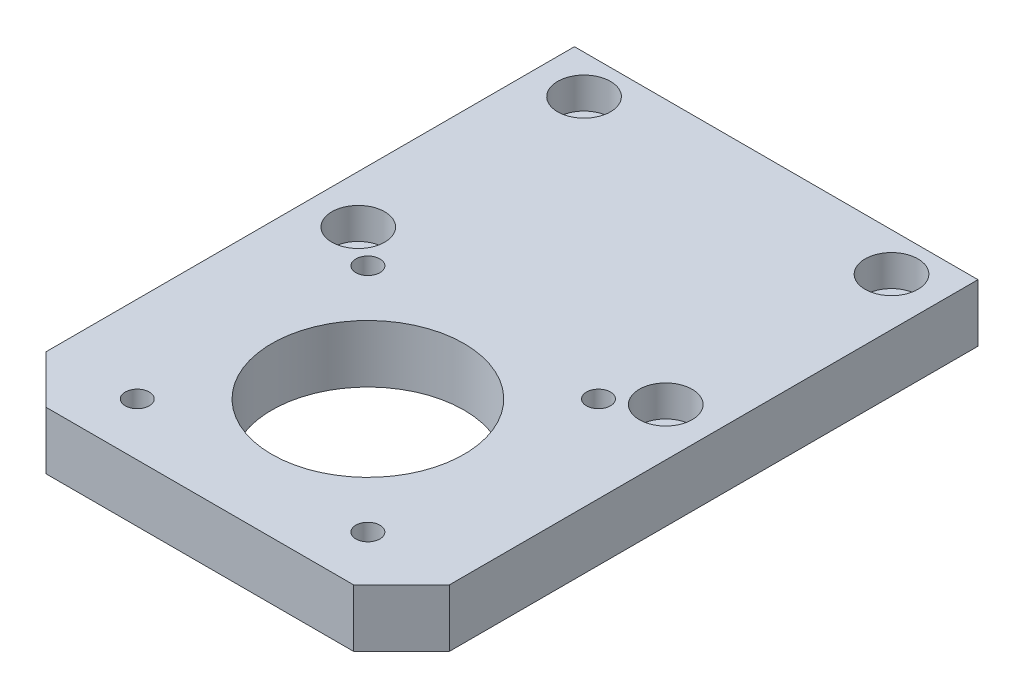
ISO-10303-21;
HEADER;
FILE_DESCRIPTION(('STEP AP214'),'2;1');
FILE_NAME('part.step','',(''),(''),'','','');
FILE_SCHEMA(('AUTOMOTIVE_DESIGN { 1 0 10303 214 1 1 1 1 }'));
ENDSEC;
DATA;
#1=APPLICATION_CONTEXT('core data for automotive mechanical design processes');
#2=APPLICATION_PROTOCOL_DEFINITION('international standard','automotive_design',2000,#1);
#3=PRODUCT_CONTEXT('',#1,'mechanical');
#4=PRODUCT('Part','Part','',(#3));
#5=PRODUCT_RELATED_PRODUCT_CATEGORY('part','',(#4));
#6=PRODUCT_DEFINITION_FORMATION('','',#4);
#7=PRODUCT_DEFINITION_CONTEXT('part definition',#1,'design');
#8=PRODUCT_DEFINITION('design','',#6,#7);
#9=PRODUCT_DEFINITION_SHAPE('','',#8);
#10=(LENGTH_UNIT() NAMED_UNIT(*) SI_UNIT(.MILLI.,.METRE.));
#11=(NAMED_UNIT(*) PLANE_ANGLE_UNIT() SI_UNIT($,.RADIAN.));
#12=(NAMED_UNIT(*) SI_UNIT($,.STERADIAN.) SOLID_ANGLE_UNIT());
#13=UNCERTAINTY_MEASURE_WITH_UNIT(LENGTH_MEASURE(1.E-05),#10,'distance_accuracy_value','');
#14=(GEOMETRIC_REPRESENTATION_CONTEXT(3) GLOBAL_UNCERTAINTY_ASSIGNED_CONTEXT((#13)) GLOBAL_UNIT_ASSIGNED_CONTEXT((#10,
#11,#12)) REPRESENTATION_CONTEXT('',''));
#15=CARTESIAN_POINT('',(0.,0.,0.));
#16=DIRECTION('',(0.,0.,1.));
#17=DIRECTION('',(1.,0.,0.));
#18=AXIS2_PLACEMENT_3D('',#15,#16,#17);
#19=CARTESIAN_POINT('',(10.,-108.,8.));
#20=DIRECTION('',(0.,1.,0.));
#21=DIRECTION('',(0.,0.,1.));
#22=AXIS2_PLACEMENT_3D('',#19,#20,#21);
#23=CYLINDRICAL_SURFACE('',#22,3.25);
#24=CARTESIAN_POINT('',(10.,0.,8.));
#25=DIRECTION('',(0.,1.,0.));
#26=DIRECTION('',(0.,0.,1.));
#27=AXIS2_PLACEMENT_3D('',#24,#25,#26);
#28=CIRCLE('',#27,3.25);
#29=CARTESIAN_POINT('',(10.,0.,11.25));
#30=VERTEX_POINT('',#29);
#31=EDGE_CURVE('E157',#30,#30,#28,.T.);
#32=ORIENTED_EDGE('',*,*,#31,.F.);
#33=EDGE_LOOP('',(#32));
#34=FACE_BOUND('',#33,.T.);
#35=CARTESIAN_POINT('',(10.,5.50000000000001,8.));
#36=DIRECTION('',(0.,1.,0.));
#37=DIRECTION('',(0.,0.,1.));
#38=AXIS2_PLACEMENT_3D('',#35,#36,#37);
#39=CIRCLE('',#38,3.25);
#40=CARTESIAN_POINT('',(10.,5.50000000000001,11.25));
#41=VERTEX_POINT('',#40);
#42=EDGE_CURVE('E37',#41,#41,#39,.F.);
#43=ORIENTED_EDGE('',*,*,#42,.F.);
#44=EDGE_LOOP('',(#43));
#45=FACE_BOUND('',#44,.T.);
#46=ADVANCED_FACE('F33',(#34,#45),#23,.F.);
#47=CARTESIAN_POINT('',(74.,-108.,8.));
#48=DIRECTION('',(0.,1.,0.));
#49=DIRECTION('',(0.,0.,1.));
#50=AXIS2_PLACEMENT_3D('',#47,#48,#49);
#51=CYLINDRICAL_SURFACE('',#50,3.25);
#52=CARTESIAN_POINT('',(74.,0.,8.));
#53=DIRECTION('',(0.,1.,0.));
#54=DIRECTION('',(0.,0.,1.));
#55=AXIS2_PLACEMENT_3D('',#52,#53,#54);
#56=CIRCLE('',#55,3.25);
#57=CARTESIAN_POINT('',(74.,0.,11.25));
#58=VERTEX_POINT('',#57);
#59=EDGE_CURVE('E160',#58,#58,#56,.T.);
#60=ORIENTED_EDGE('',*,*,#59,.F.);
#61=EDGE_LOOP('',(#60));
#62=FACE_BOUND('',#61,.T.);
#63=CARTESIAN_POINT('',(74.,5.50000000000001,8.));
#64=DIRECTION('',(0.,1.,0.));
#65=DIRECTION('',(0.,0.,1.));
#66=AXIS2_PLACEMENT_3D('',#63,#64,#65);
#67=CIRCLE('',#66,3.25);
#68=CARTESIAN_POINT('',(74.,5.50000000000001,11.25));
#69=VERTEX_POINT('',#68);
#70=EDGE_CURVE('E127',#69,#69,#67,.F.);
#71=ORIENTED_EDGE('',*,*,#70,.F.);
#72=EDGE_LOOP('',(#71));
#73=FACE_BOUND('',#72,.T.);
#74=ADVANCED_FACE('F235',(#62,#73),#51,.F.);
#75=CARTESIAN_POINT('',(74.,-108.,55.));
#76=DIRECTION('',(0.,1.,0.));
#77=DIRECTION('',(0.,0.,1.));
#78=AXIS2_PLACEMENT_3D('',#75,#76,#77);
#79=CYLINDRICAL_SURFACE('',#78,3.25);
#80=CARTESIAN_POINT('',(74.,0.,55.));
#81=DIRECTION('',(0.,1.,0.));
#82=DIRECTION('',(0.,0.,1.));
#83=AXIS2_PLACEMENT_3D('',#80,#81,#82);
#84=CIRCLE('',#83,3.25);
#85=CARTESIAN_POINT('',(74.,0.,58.25));
#86=VERTEX_POINT('',#85);
#87=EDGE_CURVE('E193',#86,#86,#84,.T.);
#88=ORIENTED_EDGE('',*,*,#87,.F.);
#89=EDGE_LOOP('',(#88));
#90=FACE_BOUND('',#89,.T.);
#91=CARTESIAN_POINT('',(74.,5.50000000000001,55.));
#92=DIRECTION('',(0.,1.,0.));
#93=DIRECTION('',(0.,0.,1.));
#94=AXIS2_PLACEMENT_3D('',#91,#92,#93);
#95=CIRCLE('',#94,3.25);
#96=CARTESIAN_POINT('',(74.,5.50000000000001,58.25));
#97=VERTEX_POINT('',#96);
#98=EDGE_CURVE('E123',#97,#97,#95,.F.);
#99=ORIENTED_EDGE('',*,*,#98,.F.);
#100=EDGE_LOOP('',(#99));
#101=FACE_BOUND('',#100,.T.);
#102=ADVANCED_FACE('F241',(#90,#101),#79,.F.);
#103=CARTESIAN_POINT('',(10.,-108.,55.));
#104=DIRECTION('',(0.,1.,0.));
#105=DIRECTION('',(0.,0.,1.));
#106=AXIS2_PLACEMENT_3D('',#103,#104,#105);
#107=CYLINDRICAL_SURFACE('',#106,3.25);
#108=CARTESIAN_POINT('',(10.,0.,55.));
#109=DIRECTION('',(0.,1.,0.));
#110=DIRECTION('',(0.,0.,1.));
#111=AXIS2_PLACEMENT_3D('',#108,#109,#110);
#112=CIRCLE('',#111,3.25);
#113=CARTESIAN_POINT('',(10.,0.,58.25));
#114=VERTEX_POINT('',#113);
#115=EDGE_CURVE('E196',#114,#114,#112,.T.);
#116=ORIENTED_EDGE('',*,*,#115,.F.);
#117=EDGE_LOOP('',(#116));
#118=FACE_BOUND('',#117,.T.);
#119=CARTESIAN_POINT('',(10.,5.50000000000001,55.));
#120=DIRECTION('',(0.,1.,0.));
#121=DIRECTION('',(0.,0.,1.));
#122=AXIS2_PLACEMENT_3D('',#119,#120,#121);
#123=CIRCLE('',#122,3.25);
#124=CARTESIAN_POINT('',(10.,5.50000000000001,58.25));
#125=VERTEX_POINT('',#124);
#126=EDGE_CURVE('E119',#125,#125,#123,.F.);
#127=ORIENTED_EDGE('',*,*,#126,.F.);
#128=EDGE_LOOP('',(#127));
#129=FACE_BOUND('',#128,.T.);
#130=ADVANCED_FACE('F269',(#118,#129),#107,.F.);
#131=CARTESIAN_POINT('',(0.,0.,120.));
#132=DIRECTION('',(1.,0.,0.));
#133=DIRECTION('',(0.,0.,-1.));
#134=AXIS2_PLACEMENT_3D('',#131,#132,#133);
#135=PLANE('',#134);
#136=DIRECTION('',(0.,1.,0.));
#137=VECTOR('',#136,1.);
#138=CARTESIAN_POINT('',(0.,-108.,110.));
#139=LINE('',#138,#137);
#140=CARTESIAN_POINT('',(0.,0.,110.));
#141=VERTEX_POINT('',#140);
#142=CARTESIAN_POINT('',(0.,12.,110.));
#143=VERTEX_POINT('',#142);
#144=EDGE_CURVE('E92',#141,#143,#139,.T.);
#145=ORIENTED_EDGE('',*,*,#144,.T.);
#146=DIRECTION('',(0.,0.,-1.));
#147=VECTOR('',#146,1.);
#148=CARTESIAN_POINT('',(0.,12.,120.));
#149=LINE('',#148,#147);
#150=CARTESIAN_POINT('',(0.,12.,0.));
#151=VERTEX_POINT('',#150);
#152=EDGE_CURVE('E110',#143,#151,#149,.T.);
#153=ORIENTED_EDGE('',*,*,#152,.T.);
#154=DIRECTION('',(0.,-1.,0.));
#155=VECTOR('',#154,1.);
#156=CARTESIAN_POINT('',(0.,0.,0.));
#157=LINE('',#156,#155);
#158=CARTESIAN_POINT('',(0.,0.,0.));
#159=VERTEX_POINT('',#158);
#160=EDGE_CURVE('E199',#151,#159,#157,.T.);
#161=ORIENTED_EDGE('',*,*,#160,.T.);
#162=DIRECTION('',(0.,0.,-1.));
#163=VECTOR('',#162,1.);
#164=CARTESIAN_POINT('',(0.,0.,120.));
#165=LINE('',#164,#163);
#166=EDGE_CURVE('E112',#141,#159,#165,.T.);
#167=ORIENTED_EDGE('',*,*,#166,.F.);
#168=EDGE_LOOP('',(#145,#153,#161,#167));
#169=FACE_BOUND('',#168,.T.);
#170=ADVANCED_FACE('F35',(#169),#135,.F.);
#171=CARTESIAN_POINT('',(0.,0.,120.));
#172=DIRECTION('',(0.,1.,0.));
#173=DIRECTION('',(0.,0.,1.));
#174=AXIS2_PLACEMENT_3D('',#171,#172,#173);
#175=PLANE('',#174);
#176=ORIENTED_EDGE('',*,*,#31,.T.);
#177=EDGE_LOOP('',(#176));
#178=FACE_BOUND('',#177,.T.);
#179=ORIENTED_EDGE('',*,*,#59,.T.);
#180=EDGE_LOOP('',(#179));
#181=FACE_BOUND('',#180,.T.);
#182=CARTESIAN_POINT('',(42.,0.,85.));
#183=DIRECTION('',(0.,1.,0.));
#184=DIRECTION('',(0.,0.,1.));
#185=AXIS2_PLACEMENT_3D('',#182,#183,#184);
#186=CIRCLE('',#185,20.);
#187=CARTESIAN_POINT('',(42.,0.,105.));
#188=VERTEX_POINT('',#187);
#189=EDGE_CURVE('E166',#188,#188,#186,.T.);
#190=ORIENTED_EDGE('',*,*,#189,.T.);
#191=EDGE_LOOP('',(#190));
#192=FACE_BOUND('',#191,.T.);
#193=CARTESIAN_POINT('',(18.,0.,109.));
#194=DIRECTION('',(0.,1.,0.));
#195=DIRECTION('',(0.,0.,1.));
#196=AXIS2_PLACEMENT_3D('',#193,#194,#195);
#197=CIRCLE('',#196,2.5);
#198=CARTESIAN_POINT('',(18.,0.,111.5));
#199=VERTEX_POINT('',#198);
#200=EDGE_CURVE('E172',#199,#199,#197,.T.);
#201=ORIENTED_EDGE('',*,*,#200,.T.);
#202=EDGE_LOOP('',(#201));
#203=FACE_BOUND('',#202,.T.);
#204=CARTESIAN_POINT('',(66.,0.,109.));
#205=DIRECTION('',(0.,1.,0.));
#206=DIRECTION('',(0.,0.,1.));
#207=AXIS2_PLACEMENT_3D('',#204,#205,#206);
#208=CIRCLE('',#207,2.5);
#209=CARTESIAN_POINT('',(66.,0.,111.5));
#210=VERTEX_POINT('',#209);
#211=EDGE_CURVE('E178',#210,#210,#208,.T.);
#212=ORIENTED_EDGE('',*,*,#211,.T.);
#213=EDGE_LOOP('',(#212));
#214=FACE_BOUND('',#213,.T.);
#215=CARTESIAN_POINT('',(66.,0.,61.));
#216=DIRECTION('',(0.,1.,0.));
#217=DIRECTION('',(0.,0.,1.));
#218=AXIS2_PLACEMENT_3D('',#215,#216,#217);
#219=CIRCLE('',#218,2.5);
#220=CARTESIAN_POINT('',(66.,0.,63.5));
#221=VERTEX_POINT('',#220);
#222=EDGE_CURVE('E184',#221,#221,#219,.T.);
#223=ORIENTED_EDGE('',*,*,#222,.T.);
#224=EDGE_LOOP('',(#223));
#225=FACE_BOUND('',#224,.T.);
#226=CARTESIAN_POINT('',(18.,0.,61.));
#227=DIRECTION('',(0.,1.,0.));
#228=DIRECTION('',(0.,0.,1.));
#229=AXIS2_PLACEMENT_3D('',#226,#227,#228);
#230=CIRCLE('',#229,2.5);
#231=CARTESIAN_POINT('',(18.,0.,63.5));
#232=VERTEX_POINT('',#231);
#233=EDGE_CURVE('E190',#232,#232,#230,.T.);
#234=ORIENTED_EDGE('',*,*,#233,.T.);
#235=EDGE_LOOP('',(#234));
#236=FACE_BOUND('',#235,.T.);
#237=ORIENTED_EDGE('',*,*,#87,.T.);
#238=EDGE_LOOP('',(#237));
#239=FACE_BOUND('',#238,.T.);
#240=ORIENTED_EDGE('',*,*,#115,.T.);
#241=EDGE_LOOP('',(#240));
#242=FACE_BOUND('',#241,.T.);
#243=DIRECTION('',(0.707106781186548,0.,0.707106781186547));
#244=VECTOR('',#243,1.);
#245=CARTESIAN_POINT('',(5.,0.,115.));
#246=LINE('',#245,#244);
#247=CARTESIAN_POINT('',(10.,0.,120.));
#248=VERTEX_POINT('',#247);
#249=EDGE_CURVE('E57',#141,#248,#246,.T.);
#250=ORIENTED_EDGE('',*,*,#249,.F.);
#251=ORIENTED_EDGE('',*,*,#166,.T.);
#252=DIRECTION('',(1.,0.,0.));
#253=VECTOR('',#252,1.);
#254=CARTESIAN_POINT('',(0.,0.,0.));
#255=LINE('',#254,#253);
#256=CARTESIAN_POINT('',(84.,0.,0.));
#257=VERTEX_POINT('',#256);
#258=EDGE_CURVE('E207',#159,#257,#255,.T.);
#259=ORIENTED_EDGE('',*,*,#258,.T.);
#260=DIRECTION('',(0.,0.,-1.));
#261=VECTOR('',#260,1.);
#262=CARTESIAN_POINT('',(84.,0.,120.));
#263=LINE('',#262,#261);
#264=CARTESIAN_POINT('',(84.,0.,110.));
#265=VERTEX_POINT('',#264);
#266=EDGE_CURVE('E109',#265,#257,#263,.T.);
#267=ORIENTED_EDGE('',*,*,#266,.F.);
#268=DIRECTION('',(0.707106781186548,0.,-0.707106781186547));
#269=VECTOR('',#268,1.);
#270=CARTESIAN_POINT('',(36.9999999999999,0.,157.));
#271=LINE('',#270,#269);
#272=CARTESIAN_POINT('',(74.,0.,120.));
#273=VERTEX_POINT('',#272);
#274=EDGE_CURVE('E88',#273,#265,#271,.T.);
#275=ORIENTED_EDGE('',*,*,#274,.F.);
#276=DIRECTION('',(1.,0.,0.));
#277=VECTOR('',#276,1.);
#278=CARTESIAN_POINT('',(0.,0.,120.));
#279=LINE('',#278,#277);
#280=EDGE_CURVE('E200',#248,#273,#279,.T.);
#281=ORIENTED_EDGE('',*,*,#280,.F.);
#282=EDGE_LOOP('',(#250,#251,#259,#267,#275,#281));
#283=FACE_BOUND('',#282,.T.);
#284=ADVANCED_FACE('F220',(#178,#181,#192,#203,#214,#225,#236,#239,#242,#283),#175,.F.);
#285=CARTESIAN_POINT('',(84.,0.,120.));
#286=DIRECTION('',(-1.,0.,0.));
#287=DIRECTION('',(0.,0.,1.));
#288=AXIS2_PLACEMENT_3D('',#285,#286,#287);
#289=PLANE('',#288);
#290=DIRECTION('',(0.,1.,0.));
#291=VECTOR('',#290,1.);
#292=CARTESIAN_POINT('',(84.,-108.,110.));
#293=LINE('',#292,#291);
#294=CARTESIAN_POINT('',(84.,12.,110.));
#295=VERTEX_POINT('',#294);
#296=EDGE_CURVE('E85',#265,#295,#293,.T.);
#297=ORIENTED_EDGE('',*,*,#296,.F.);
#298=ORIENTED_EDGE('',*,*,#266,.T.);
#299=DIRECTION('',(0.,1.,0.));
#300=VECTOR('',#299,1.);
#301=CARTESIAN_POINT('',(84.,0.,0.));
#302=LINE('',#301,#300);
#303=CARTESIAN_POINT('',(84.,12.,0.));
#304=VERTEX_POINT('',#303);
#305=EDGE_CURVE('E107',#257,#304,#302,.T.);
#306=ORIENTED_EDGE('',*,*,#305,.T.);
#307=DIRECTION('',(0.,0.,-1.));
#308=VECTOR('',#307,1.);
#309=CARTESIAN_POINT('',(84.,12.,120.));
#310=LINE('',#309,#308);
#311=EDGE_CURVE('E99',#295,#304,#310,.T.);
#312=ORIENTED_EDGE('',*,*,#311,.F.);
#313=EDGE_LOOP('',(#297,#298,#306,#312));
#314=FACE_BOUND('',#313,.T.);
#315=ADVANCED_FACE('F105',(#314),#289,.F.);
#316=CARTESIAN_POINT('',(0.,12.,120.));
#317=DIRECTION('',(0.,-1.,0.));
#318=DIRECTION('',(0.,0.,-1.));
#319=AXIS2_PLACEMENT_3D('',#316,#317,#318);
#320=PLANE('',#319);
#321=CARTESIAN_POINT('',(10.,12.,8.));
#322=DIRECTION('',(0.,1.,0.));
#323=DIRECTION('',(0.,0.,1.));
#324=AXIS2_PLACEMENT_3D('',#321,#322,#323);
#325=CIRCLE('',#324,5.5);
#326=CARTESIAN_POINT('',(10.,12.,13.5));
#327=VERTEX_POINT('',#326);
#328=EDGE_CURVE('E143',#327,#327,#325,.T.);
#329=ORIENTED_EDGE('',*,*,#328,.F.);
#330=EDGE_LOOP('',(#329));
#331=FACE_BOUND('',#330,.T.);
#332=CARTESIAN_POINT('',(74.,12.,8.));
#333=DIRECTION('',(0.,1.,0.));
#334=DIRECTION('',(0.,0.,1.));
#335=AXIS2_PLACEMENT_3D('',#332,#333,#334);
#336=CIRCLE('',#335,5.50000000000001);
#337=CARTESIAN_POINT('',(74.,12.,13.5));
#338=VERTEX_POINT('',#337);
#339=EDGE_CURVE('E136',#338,#338,#336,.T.);
#340=ORIENTED_EDGE('',*,*,#339,.F.);
#341=EDGE_LOOP('',(#340));
#342=FACE_BOUND('',#341,.T.);
#343=CARTESIAN_POINT('',(74.,12.,55.));
#344=DIRECTION('',(0.,1.,0.));
#345=DIRECTION('',(0.,0.,1.));
#346=AXIS2_PLACEMENT_3D('',#343,#344,#345);
#347=CIRCLE('',#346,5.50000000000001);
#348=CARTESIAN_POINT('',(74.,12.,60.5));
#349=VERTEX_POINT('',#348);
#350=EDGE_CURVE('E129',#349,#349,#347,.T.);
#351=ORIENTED_EDGE('',*,*,#350,.F.);
#352=EDGE_LOOP('',(#351));
#353=FACE_BOUND('',#352,.T.);
#354=CARTESIAN_POINT('',(10.,12.,55.));
#355=DIRECTION('',(0.,1.,0.));
#356=DIRECTION('',(0.,0.,1.));
#357=AXIS2_PLACEMENT_3D('',#354,#355,#356);
#358=CIRCLE('',#357,5.5);
#359=CARTESIAN_POINT('',(10.,12.,60.5));
#360=VERTEX_POINT('',#359);
#361=EDGE_CURVE('E125',#360,#360,#358,.T.);
#362=ORIENTED_EDGE('',*,*,#361,.F.);
#363=EDGE_LOOP('',(#362));
#364=FACE_BOUND('',#363,.T.);
#365=CARTESIAN_POINT('',(42.,12.,85.));
#366=DIRECTION('',(0.,1.,0.));
#367=DIRECTION('',(0.,0.,1.));
#368=AXIS2_PLACEMENT_3D('',#365,#366,#367);
#369=CIRCLE('',#368,20.);
#370=CARTESIAN_POINT('',(42.,12.,105.));
#371=VERTEX_POINT('',#370);
#372=EDGE_CURVE('E163',#371,#371,#369,.T.);
#373=ORIENTED_EDGE('',*,*,#372,.F.);
#374=EDGE_LOOP('',(#373));
#375=FACE_BOUND('',#374,.T.);
#376=CARTESIAN_POINT('',(18.,12.,109.));
#377=DIRECTION('',(0.,1.,0.));
#378=DIRECTION('',(0.,0.,1.));
#379=AXIS2_PLACEMENT_3D('',#376,#377,#378);
#380=CIRCLE('',#379,2.5);
#381=CARTESIAN_POINT('',(18.,12.,111.5));
#382=VERTEX_POINT('',#381);
#383=EDGE_CURVE('E169',#382,#382,#380,.T.);
#384=ORIENTED_EDGE('',*,*,#383,.F.);
#385=EDGE_LOOP('',(#384));
#386=FACE_BOUND('',#385,.T.);
#387=CARTESIAN_POINT('',(66.,12.,109.));
#388=DIRECTION('',(0.,1.,0.));
#389=DIRECTION('',(0.,0.,1.));
#390=AXIS2_PLACEMENT_3D('',#387,#388,#389);
#391=CIRCLE('',#390,2.5);
#392=CARTESIAN_POINT('',(66.,12.,111.5));
#393=VERTEX_POINT('',#392);
#394=EDGE_CURVE('E175',#393,#393,#391,.T.);
#395=ORIENTED_EDGE('',*,*,#394,.F.);
#396=EDGE_LOOP('',(#395));
#397=FACE_BOUND('',#396,.T.);
#398=CARTESIAN_POINT('',(66.,12.,61.));
#399=DIRECTION('',(0.,1.,0.));
#400=DIRECTION('',(0.,0.,1.));
#401=AXIS2_PLACEMENT_3D('',#398,#399,#400);
#402=CIRCLE('',#401,2.5);
#403=CARTESIAN_POINT('',(66.,12.,63.5));
#404=VERTEX_POINT('',#403);
#405=EDGE_CURVE('E181',#404,#404,#402,.T.);
#406=ORIENTED_EDGE('',*,*,#405,.F.);
#407=EDGE_LOOP('',(#406));
#408=FACE_BOUND('',#407,.T.);
#409=CARTESIAN_POINT('',(18.,12.,61.));
#410=DIRECTION('',(0.,1.,0.));
#411=DIRECTION('',(0.,0.,1.));
#412=AXIS2_PLACEMENT_3D('',#409,#410,#411);
#413=CIRCLE('',#412,2.5);
#414=CARTESIAN_POINT('',(18.,12.,63.5));
#415=VERTEX_POINT('',#414);
#416=EDGE_CURVE('E187',#415,#415,#413,.T.);
#417=ORIENTED_EDGE('',*,*,#416,.F.);
#418=EDGE_LOOP('',(#417));
#419=FACE_BOUND('',#418,.T.);
#420=DIRECTION('',(0.707106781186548,0.,0.707106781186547));
#421=VECTOR('',#420,1.);
#422=CARTESIAN_POINT('',(10.,12.,120.));
#423=LINE('',#422,#421);
#424=CARTESIAN_POINT('',(10.,12.,120.));
#425=VERTEX_POINT('',#424);
#426=EDGE_CURVE('E103',#143,#425,#423,.T.);
#427=ORIENTED_EDGE('',*,*,#426,.T.);
#428=DIRECTION('',(-1.,0.,0.));
#429=VECTOR('',#428,1.);
#430=CARTESIAN_POINT('',(0.,12.,120.));
#431=LINE('',#430,#429);
#432=CARTESIAN_POINT('',(74.,12.,120.));
#433=VERTEX_POINT('',#432);
#434=EDGE_CURVE('E102',#433,#425,#431,.T.);
#435=ORIENTED_EDGE('',*,*,#434,.F.);
#436=DIRECTION('',(0.707106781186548,0.,-0.707106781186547));
#437=VECTOR('',#436,1.);
#438=CARTESIAN_POINT('',(84.,12.,110.));
#439=LINE('',#438,#437);
#440=EDGE_CURVE('E50',#433,#295,#439,.T.);
#441=ORIENTED_EDGE('',*,*,#440,.T.);
#442=ORIENTED_EDGE('',*,*,#311,.T.);
#443=DIRECTION('',(-1.,0.,0.));
#444=VECTOR('',#443,1.);
#445=CARTESIAN_POINT('',(0.,12.,0.));
#446=LINE('',#445,#444);
#447=EDGE_CURVE('E203',#304,#151,#446,.T.);
#448=ORIENTED_EDGE('',*,*,#447,.T.);
#449=ORIENTED_EDGE('',*,*,#152,.F.);
#450=EDGE_LOOP('',(#427,#435,#441,#442,#448,#449));
#451=FACE_BOUND('',#450,.T.);
#452=ADVANCED_FACE('F97',(#331,#342,#353,#364,#375,#386,#397,#408,#419,#451),#320,.F.);
#453=CARTESIAN_POINT('',(0.,12.,120.));
#454=DIRECTION('',(0.,0.,-1.));
#455=DIRECTION('',(-1.,0.,0.));
#456=AXIS2_PLACEMENT_3D('',#453,#454,#455);
#457=PLANE('',#456);
#458=DIRECTION('',(0.,1.,0.));
#459=VECTOR('',#458,1.);
#460=CARTESIAN_POINT('',(10.,12.,120.));
#461=LINE('',#460,#459);
#462=EDGE_CURVE('E12',#248,#425,#461,.T.);
#463=ORIENTED_EDGE('',*,*,#462,.F.);
#464=ORIENTED_EDGE('',*,*,#280,.T.);
#465=DIRECTION('',(0.,-1.,0.));
#466=VECTOR('',#465,1.);
#467=CARTESIAN_POINT('',(74.,12.,120.));
#468=LINE('',#467,#466);
#469=EDGE_CURVE('E42',#433,#273,#468,.T.);
#470=ORIENTED_EDGE('',*,*,#469,.F.);
#471=ORIENTED_EDGE('',*,*,#434,.T.);
#472=EDGE_LOOP('',(#463,#464,#470,#471));
#473=FACE_BOUND('',#472,.T.);
#474=ADVANCED_FACE('F222',(#473),#457,.F.);
#475=CARTESIAN_POINT('',(0.,12.,0.));
#476=DIRECTION('',(0.,0.,-1.));
#477=DIRECTION('',(-1.,0.,0.));
#478=AXIS2_PLACEMENT_3D('',#475,#476,#477);
#479=PLANE('',#478);
#480=ORIENTED_EDGE('',*,*,#160,.F.);
#481=ORIENTED_EDGE('',*,*,#447,.F.);
#482=ORIENTED_EDGE('',*,*,#305,.F.);
#483=ORIENTED_EDGE('',*,*,#258,.F.);
#484=EDGE_LOOP('',(#480,#481,#482,#483));
#485=FACE_BOUND('',#484,.T.);
#486=ADVANCED_FACE('F214',(#485),#479,.T.);
#487=CARTESIAN_POINT('',(18.,-108.,61.));
#488=DIRECTION('',(0.,1.,0.));
#489=DIRECTION('',(0.,0.,1.));
#490=AXIS2_PLACEMENT_3D('',#487,#488,#489);
#491=CYLINDRICAL_SURFACE('',#490,2.5);
#492=ORIENTED_EDGE('',*,*,#416,.T.);
#493=EDGE_LOOP('',(#492));
#494=FACE_BOUND('',#493,.T.);
#495=ORIENTED_EDGE('',*,*,#233,.F.);
#496=EDGE_LOOP('',(#495));
#497=FACE_BOUND('',#496,.T.);
#498=ADVANCED_FACE('F229',(#494,#497),#491,.F.);
#499=CARTESIAN_POINT('',(66.,-108.,61.));
#500=DIRECTION('',(0.,1.,0.));
#501=DIRECTION('',(0.,0.,1.));
#502=AXIS2_PLACEMENT_3D('',#499,#500,#501);
#503=CYLINDRICAL_SURFACE('',#502,2.5);
#504=ORIENTED_EDGE('',*,*,#405,.T.);
#505=EDGE_LOOP('',(#504));
#506=FACE_BOUND('',#505,.T.);
#507=ORIENTED_EDGE('',*,*,#222,.F.);
#508=EDGE_LOOP('',(#507));
#509=FACE_BOUND('',#508,.T.);
#510=ADVANCED_FACE('F260',(#506,#509),#503,.F.);
#511=CARTESIAN_POINT('',(66.,-108.,109.));
#512=DIRECTION('',(0.,1.,0.));
#513=DIRECTION('',(0.,0.,1.));
#514=AXIS2_PLACEMENT_3D('',#511,#512,#513);
#515=CYLINDRICAL_SURFACE('',#514,2.5);
#516=ORIENTED_EDGE('',*,*,#394,.T.);
#517=EDGE_LOOP('',(#516));
#518=FACE_BOUND('',#517,.T.);
#519=ORIENTED_EDGE('',*,*,#211,.F.);
#520=EDGE_LOOP('',(#519));
#521=FACE_BOUND('',#520,.T.);
#522=ADVANCED_FACE('F256',(#518,#521),#515,.F.);
#523=CARTESIAN_POINT('',(18.,-108.,109.));
#524=DIRECTION('',(0.,1.,0.));
#525=DIRECTION('',(0.,0.,1.));
#526=AXIS2_PLACEMENT_3D('',#523,#524,#525);
#527=CYLINDRICAL_SURFACE('',#526,2.5);
#528=ORIENTED_EDGE('',*,*,#383,.T.);
#529=EDGE_LOOP('',(#528));
#530=FACE_BOUND('',#529,.T.);
#531=ORIENTED_EDGE('',*,*,#200,.F.);
#532=EDGE_LOOP('',(#531));
#533=FACE_BOUND('',#532,.T.);
#534=ADVANCED_FACE('F252',(#530,#533),#527,.F.);
#535=CARTESIAN_POINT('',(42.,-108.,85.));
#536=DIRECTION('',(0.,1.,0.));
#537=DIRECTION('',(0.,0.,1.));
#538=AXIS2_PLACEMENT_3D('',#535,#536,#537);
#539=CYLINDRICAL_SURFACE('',#538,20.);
#540=ORIENTED_EDGE('',*,*,#372,.T.);
#541=EDGE_LOOP('',(#540));
#542=FACE_BOUND('',#541,.T.);
#543=ORIENTED_EDGE('',*,*,#189,.F.);
#544=EDGE_LOOP('',(#543));
#545=FACE_BOUND('',#544,.T.);
#546=ADVANCED_FACE('F249',(#542,#545),#539,.F.);
#547=CARTESIAN_POINT('',(84.,-108.,110.));
#548=DIRECTION('',(0.707106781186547,0.,0.707106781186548));
#549=DIRECTION('',(0.707106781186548,0.,-0.707106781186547));
#550=AXIS2_PLACEMENT_3D('',#547,#548,#549);
#551=PLANE('',#550);
#552=ORIENTED_EDGE('',*,*,#274,.T.);
#553=ORIENTED_EDGE('',*,*,#296,.T.);
#554=ORIENTED_EDGE('',*,*,#440,.F.);
#555=ORIENTED_EDGE('',*,*,#469,.T.);
#556=EDGE_LOOP('',(#552,#553,#554,#555));
#557=FACE_BOUND('',#556,.T.);
#558=ADVANCED_FACE('F86',(#557),#551,.T.);
#559=CARTESIAN_POINT('',(10.,-108.,120.));
#560=DIRECTION('',(-0.707106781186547,0.,0.707106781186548));
#561=DIRECTION('',(0.707106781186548,0.,0.707106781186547));
#562=AXIS2_PLACEMENT_3D('',#559,#560,#561);
#563=PLANE('',#562);
#564=ORIENTED_EDGE('',*,*,#249,.T.);
#565=ORIENTED_EDGE('',*,*,#462,.T.);
#566=ORIENTED_EDGE('',*,*,#426,.F.);
#567=ORIENTED_EDGE('',*,*,#144,.F.);
#568=EDGE_LOOP('',(#564,#565,#566,#567));
#569=FACE_BOUND('',#568,.T.);
#570=ADVANCED_FACE('F217',(#569),#563,.T.);
#571=CARTESIAN_POINT('',(10.,5.5,55.));
#572=DIRECTION('',(0.,1.,0.));
#573=DIRECTION('',(0.,0.,1.));
#574=AXIS2_PLACEMENT_3D('',#571,#572,#573);
#575=PLANE('',#574);
#576=CARTESIAN_POINT('',(10.,5.5,55.));
#577=DIRECTION('',(0.,1.,0.));
#578=DIRECTION('',(0.,0.,1.));
#579=AXIS2_PLACEMENT_3D('',#576,#577,#578);
#580=CIRCLE('',#579,5.5);
#581=CARTESIAN_POINT('',(10.,5.5,60.5));
#582=VERTEX_POINT('',#581);
#583=EDGE_CURVE('E122',#582,#582,#580,.T.);
#584=ORIENTED_EDGE('',*,*,#583,.T.);
#585=EDGE_LOOP('',(#584));
#586=FACE_BOUND('',#585,.T.);
#587=ORIENTED_EDGE('',*,*,#126,.T.);
#588=EDGE_LOOP('',(#587));
#589=FACE_BOUND('',#588,.T.);
#590=ADVANCED_FACE('F280',(#586,#589),#575,.T.);
#591=CARTESIAN_POINT('',(10.,5.5,55.));
#592=DIRECTION('',(0.,1.,0.));
#593=DIRECTION('',(0.,0.,1.));
#594=AXIS2_PLACEMENT_3D('',#591,#592,#593);
#595=CYLINDRICAL_SURFACE('',#594,5.5);
#596=CARTESIAN_POINT('',(10.,5.5,60.5));
#597=CARTESIAN_POINT('',(10.,5.56770833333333,60.5));
#598=CARTESIAN_POINT('',(10.,5.63541666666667,60.5));
#599=CARTESIAN_POINT('',(10.,5.77083333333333,60.5));
#600=CARTESIAN_POINT('',(10.,5.83854166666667,60.5));
#601=CARTESIAN_POINT('',(10.,5.97395833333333,60.5));
#602=CARTESIAN_POINT('',(10.,6.04166666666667,60.5));
#603=CARTESIAN_POINT('',(10.,6.17708333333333,60.5));
#604=CARTESIAN_POINT('',(10.,6.24479166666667,60.5));
#605=CARTESIAN_POINT('',(10.,6.38020833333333,60.5));
#606=CARTESIAN_POINT('',(10.,6.44791666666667,60.5));
#607=CARTESIAN_POINT('',(10.,6.58333333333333,60.5));
#608=CARTESIAN_POINT('',(10.,6.65104166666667,60.5));
#609=CARTESIAN_POINT('',(10.,6.78645833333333,60.5));
#610=CARTESIAN_POINT('',(10.,6.85416666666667,60.5));
#611=CARTESIAN_POINT('',(10.,6.98958333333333,60.5));
#612=CARTESIAN_POINT('',(10.,7.05729166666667,60.5));
#613=CARTESIAN_POINT('',(10.,7.19270833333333,60.5));
#614=CARTESIAN_POINT('',(10.,7.26041666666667,60.5));
#615=CARTESIAN_POINT('',(10.,7.39583333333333,60.5));
#616=CARTESIAN_POINT('',(10.,7.46354166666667,60.5));
#617=CARTESIAN_POINT('',(10.,7.59895833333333,60.5));
#618=CARTESIAN_POINT('',(10.,7.66666666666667,60.5));
#619=CARTESIAN_POINT('',(10.,7.80208333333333,60.5));
#620=CARTESIAN_POINT('',(10.,7.86979166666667,60.5));
#621=CARTESIAN_POINT('',(10.,8.00520833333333,60.5));
#622=CARTESIAN_POINT('',(10.,8.07291666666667,60.5));
#623=CARTESIAN_POINT('',(10.,8.20833333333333,60.5));
#624=CARTESIAN_POINT('',(10.,8.27604166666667,60.5));
#625=CARTESIAN_POINT('',(10.,8.41145833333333,60.5));
#626=CARTESIAN_POINT('',(10.,8.47916666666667,60.5));
#627=CARTESIAN_POINT('',(10.,8.61458333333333,60.5));
#628=CARTESIAN_POINT('',(10.,8.68229166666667,60.5));
#629=CARTESIAN_POINT('',(10.,8.81770833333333,60.5));
#630=CARTESIAN_POINT('',(10.,8.88541666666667,60.5));
#631=CARTESIAN_POINT('',(10.,9.02083333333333,60.5));
#632=CARTESIAN_POINT('',(10.,9.08854166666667,60.5));
#633=CARTESIAN_POINT('',(10.,9.22395833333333,60.5));
#634=CARTESIAN_POINT('',(10.,9.29166666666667,60.5));
#635=CARTESIAN_POINT('',(10.,9.42708333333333,60.5));
#636=CARTESIAN_POINT('',(10.,9.49479166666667,60.5));
#637=CARTESIAN_POINT('',(10.,9.63020833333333,60.5));
#638=CARTESIAN_POINT('',(10.,9.69791666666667,60.5));
#639=CARTESIAN_POINT('',(10.,9.83333333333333,60.5));
#640=CARTESIAN_POINT('',(10.,9.90104166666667,60.5));
#641=CARTESIAN_POINT('',(10.,10.0364583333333,60.5));
#642=CARTESIAN_POINT('',(10.,10.1041666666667,60.5));
#643=CARTESIAN_POINT('',(10.,10.2395833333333,60.5));
#644=CARTESIAN_POINT('',(10.,10.3072916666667,60.5));
#645=CARTESIAN_POINT('',(10.,10.4427083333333,60.5));
#646=CARTESIAN_POINT('',(10.,10.5104166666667,60.5));
#647=CARTESIAN_POINT('',(10.,10.6458333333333,60.5));
#648=CARTESIAN_POINT('',(10.,10.7135416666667,60.5));
#649=CARTESIAN_POINT('',(10.,10.8489583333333,60.5));
#650=CARTESIAN_POINT('',(10.,10.9166666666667,60.5));
#651=CARTESIAN_POINT('',(10.,11.0520833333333,60.5));
#652=CARTESIAN_POINT('',(10.,11.1197916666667,60.5));
#653=CARTESIAN_POINT('',(10.,11.2552083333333,60.5));
#654=CARTESIAN_POINT('',(10.,11.3229166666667,60.5));
#655=CARTESIAN_POINT('',(10.,11.4583333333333,60.5));
#656=CARTESIAN_POINT('',(10.,11.5260416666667,60.5));
#657=CARTESIAN_POINT('',(10.,11.6614583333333,60.5));
#658=CARTESIAN_POINT('',(10.,11.7291666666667,60.5));
#659=CARTESIAN_POINT('',(10.,11.8645833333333,60.5));
#660=CARTESIAN_POINT('',(10.,11.9322916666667,60.5));
#661=CARTESIAN_POINT('',(10.,12.,60.5));
#662=B_SPLINE_CURVE_WITH_KNOTS('',3,(#596,#597,#598,#599,#600,#601,#602,#603,#604,#605,#606,
#607,#608,#609,#610,#611,#612,#613,#614,#615,#616,#617,#618,#619,#620,#621,#622,#623,#624,#625,
#626,#627,#628,#629,#630,#631,#632,#633,#634,#635,#636,#637,#638,#639,#640,#641,#642,#643,#644,
#645,#646,#647,#648,#649,#650,#651,#652,#653,#654,#655,#656,#657,#658,#659,#660,#661),
.UNSPECIFIED.,.F.,.F.,(4,2,2,2,2,2,2,2,2,2,2,2,2,2,2,2,2,2,2,2,2,2,2,2,2,2,2,2,2,2,2,2,4),(0.,
0.203125,0.40625,0.609375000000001,0.812500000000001,1.015625,1.21875,1.421875,1.625,1.828125,
2.03125,2.234375,2.4375,2.640625,2.84375,3.046875,3.25,3.453125,3.65625,3.859375,4.0625,
4.265625,4.46875,4.671875,4.875,5.078125,5.28125,5.484375,5.6875,5.890625,6.09375,6.296875,6.5),.UNSPECIFIED.);
#663=EDGE_CURVE('BSEAM282',#582,#360,#662,.T.);
#664=ORIENTED_EDGE('',*,*,#583,.F.);
#665=ORIENTED_EDGE('',*,*,#361,.T.);
#666=ORIENTED_EDGE('',*,*,#663,.T.);
#667=ORIENTED_EDGE('',*,*,#663,.F.);
#668=EDGE_LOOP('',(#664,#666,#665,#667));
#669=FACE_BOUND('',#668,.T.);
#670=ADVANCED_FACE('F282',(#669),#595,.F.);
#671=CARTESIAN_POINT('',(74.,5.5,55.));
#672=DIRECTION('',(0.,1.,0.));
#673=DIRECTION('',(0.,0.,1.));
#674=AXIS2_PLACEMENT_3D('',#671,#672,#673);
#675=PLANE('',#674);
#676=CARTESIAN_POINT('',(74.,5.5,55.));
#677=DIRECTION('',(0.,1.,0.));
#678=DIRECTION('',(0.,0.,1.));
#679=AXIS2_PLACEMENT_3D('',#676,#677,#678);
#680=CIRCLE('',#679,5.50000000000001);
#681=CARTESIAN_POINT('',(74.,5.5,60.5));
#682=VERTEX_POINT('',#681);
#683=EDGE_CURVE('E126',#682,#682,#680,.T.);
#684=ORIENTED_EDGE('',*,*,#683,.T.);
#685=EDGE_LOOP('',(#684));
#686=FACE_BOUND('',#685,.T.);
#687=ORIENTED_EDGE('',*,*,#98,.T.);
#688=EDGE_LOOP('',(#687));
#689=FACE_BOUND('',#688,.T.);
#690=ADVANCED_FACE('F289',(#686,#689),#675,.T.);
#691=CARTESIAN_POINT('',(74.,5.5,55.));
#692=DIRECTION('',(0.,1.,0.));
#693=DIRECTION('',(0.,0.,1.));
#694=AXIS2_PLACEMENT_3D('',#691,#692,#693);
#695=CYLINDRICAL_SURFACE('',#694,5.50000000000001);
#696=CARTESIAN_POINT('',(74.,5.5,60.5));
#697=CARTESIAN_POINT('',(74.,5.56770833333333,60.5));
#698=CARTESIAN_POINT('',(74.,5.63541666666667,60.5));
#699=CARTESIAN_POINT('',(74.,5.77083333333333,60.5));
#700=CARTESIAN_POINT('',(74.,5.83854166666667,60.5));
#701=CARTESIAN_POINT('',(74.,5.97395833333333,60.5));
#702=CARTESIAN_POINT('',(74.,6.04166666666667,60.5));
#703=CARTESIAN_POINT('',(74.,6.17708333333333,60.5));
#704=CARTESIAN_POINT('',(74.,6.24479166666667,60.5));
#705=CARTESIAN_POINT('',(74.,6.38020833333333,60.5));
#706=CARTESIAN_POINT('',(74.,6.44791666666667,60.5));
#707=CARTESIAN_POINT('',(74.,6.58333333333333,60.5));
#708=CARTESIAN_POINT('',(74.,6.65104166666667,60.5));
#709=CARTESIAN_POINT('',(74.,6.78645833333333,60.5));
#710=CARTESIAN_POINT('',(74.,6.85416666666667,60.5));
#711=CARTESIAN_POINT('',(74.,6.98958333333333,60.5));
#712=CARTESIAN_POINT('',(74.,7.05729166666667,60.5));
#713=CARTESIAN_POINT('',(74.,7.19270833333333,60.5));
#714=CARTESIAN_POINT('',(74.,7.26041666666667,60.5));
#715=CARTESIAN_POINT('',(74.,7.39583333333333,60.5));
#716=CARTESIAN_POINT('',(74.,7.46354166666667,60.5));
#717=CARTESIAN_POINT('',(74.,7.59895833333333,60.5));
#718=CARTESIAN_POINT('',(74.,7.66666666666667,60.5));
#719=CARTESIAN_POINT('',(74.,7.80208333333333,60.5));
#720=CARTESIAN_POINT('',(74.,7.86979166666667,60.5));
#721=CARTESIAN_POINT('',(74.,8.00520833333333,60.5));
#722=CARTESIAN_POINT('',(74.,8.07291666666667,60.5));
#723=CARTESIAN_POINT('',(74.,8.20833333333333,60.5));
#724=CARTESIAN_POINT('',(74.,8.27604166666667,60.5));
#725=CARTESIAN_POINT('',(74.,8.41145833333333,60.5));
#726=CARTESIAN_POINT('',(74.,8.47916666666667,60.5));
#727=CARTESIAN_POINT('',(74.,8.61458333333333,60.5));
#728=CARTESIAN_POINT('',(74.,8.68229166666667,60.5));
#729=CARTESIAN_POINT('',(74.,8.81770833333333,60.5));
#730=CARTESIAN_POINT('',(74.,8.88541666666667,60.5));
#731=CARTESIAN_POINT('',(74.,9.02083333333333,60.5));
#732=CARTESIAN_POINT('',(74.,9.08854166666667,60.5));
#733=CARTESIAN_POINT('',(74.,9.22395833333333,60.5));
#734=CARTESIAN_POINT('',(74.,9.29166666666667,60.5));
#735=CARTESIAN_POINT('',(74.,9.42708333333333,60.5));
#736=CARTESIAN_POINT('',(74.,9.49479166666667,60.5));
#737=CARTESIAN_POINT('',(74.,9.63020833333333,60.5));
#738=CARTESIAN_POINT('',(74.,9.69791666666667,60.5));
#739=CARTESIAN_POINT('',(74.,9.83333333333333,60.5));
#740=CARTESIAN_POINT('',(74.,9.90104166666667,60.5));
#741=CARTESIAN_POINT('',(74.,10.0364583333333,60.5));
#742=CARTESIAN_POINT('',(74.,10.1041666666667,60.5));
#743=CARTESIAN_POINT('',(74.,10.2395833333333,60.5));
#744=CARTESIAN_POINT('',(74.,10.3072916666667,60.5));
#745=CARTESIAN_POINT('',(74.,10.4427083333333,60.5));
#746=CARTESIAN_POINT('',(74.,10.5104166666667,60.5));
#747=CARTESIAN_POINT('',(74.,10.6458333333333,60.5));
#748=CARTESIAN_POINT('',(74.,10.7135416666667,60.5));
#749=CARTESIAN_POINT('',(74.,10.8489583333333,60.5));
#750=CARTESIAN_POINT('',(74.,10.9166666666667,60.5));
#751=CARTESIAN_POINT('',(74.,11.0520833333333,60.5));
#752=CARTESIAN_POINT('',(74.,11.1197916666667,60.5));
#753=CARTESIAN_POINT('',(74.,11.2552083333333,60.5));
#754=CARTESIAN_POINT('',(74.,11.3229166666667,60.5));
#755=CARTESIAN_POINT('',(74.,11.4583333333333,60.5));
#756=CARTESIAN_POINT('',(74.,11.5260416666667,60.5));
#757=CARTESIAN_POINT('',(74.,11.6614583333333,60.5));
#758=CARTESIAN_POINT('',(74.,11.7291666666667,60.5));
#759=CARTESIAN_POINT('',(74.,11.8645833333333,60.5));
#760=CARTESIAN_POINT('',(74.,11.9322916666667,60.5));
#761=CARTESIAN_POINT('',(74.,12.,60.5));
#762=B_SPLINE_CURVE_WITH_KNOTS('',3,(#696,#697,#698,#699,#700,#701,#702,#703,#704,#705,#706,
#707,#708,#709,#710,#711,#712,#713,#714,#715,#716,#717,#718,#719,#720,#721,#722,#723,#724,#725,
#726,#727,#728,#729,#730,#731,#732,#733,#734,#735,#736,#737,#738,#739,#740,#741,#742,#743,#744,
#745,#746,#747,#748,#749,#750,#751,#752,#753,#754,#755,#756,#757,#758,#759,#760,#761),
.UNSPECIFIED.,.F.,.F.,(4,2,2,2,2,2,2,2,2,2,2,2,2,2,2,2,2,2,2,2,2,2,2,2,2,2,2,2,2,2,2,2,4),(0.,
0.203125,0.40625,0.609375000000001,0.812500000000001,1.015625,1.21875,1.421875,1.625,1.828125,
2.03125,2.234375,2.4375,2.640625,2.84375,3.046875,3.25,3.453125,3.65625,3.859375,4.0625,
4.265625,4.46875,4.671875,4.875,5.078125,5.28125,5.484375,5.6875,5.890625,6.09375,6.296875,6.5),.UNSPECIFIED.);
#763=EDGE_CURVE('BSEAM293',#682,#349,#762,.T.);
#764=ORIENTED_EDGE('',*,*,#683,.F.);
#765=ORIENTED_EDGE('',*,*,#350,.T.);
#766=ORIENTED_EDGE('',*,*,#763,.T.);
#767=ORIENTED_EDGE('',*,*,#763,.F.);
#768=EDGE_LOOP('',(#764,#766,#765,#767));
#769=FACE_BOUND('',#768,.T.);
#770=ADVANCED_FACE('F293',(#769),#695,.F.);
#771=CARTESIAN_POINT('',(74.,5.5,8.));
#772=DIRECTION('',(0.,1.,0.));
#773=DIRECTION('',(0.,0.,1.));
#774=AXIS2_PLACEMENT_3D('',#771,#772,#773);
#775=PLANE('',#774);
#776=CARTESIAN_POINT('',(74.,5.5,8.));
#777=DIRECTION('',(0.,1.,0.));
#778=DIRECTION('',(0.,0.,1.));
#779=AXIS2_PLACEMENT_3D('',#776,#777,#778);
#780=CIRCLE('',#779,5.50000000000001);
#781=CARTESIAN_POINT('',(74.,5.5,13.5));
#782=VERTEX_POINT('',#781);
#783=EDGE_CURVE('E130',#782,#782,#780,.T.);
#784=ORIENTED_EDGE('',*,*,#783,.T.);
#785=EDGE_LOOP('',(#784));
#786=FACE_BOUND('',#785,.T.);
#787=ORIENTED_EDGE('',*,*,#70,.T.);
#788=EDGE_LOOP('',(#787));
#789=FACE_BOUND('',#788,.T.);
#790=ADVANCED_FACE('F360',(#786,#789),#775,.T.);
#791=CARTESIAN_POINT('',(74.,5.5,8.));
#792=DIRECTION('',(0.,1.,0.));
#793=DIRECTION('',(0.,0.,1.));
#794=AXIS2_PLACEMENT_3D('',#791,#792,#793);
#795=CYLINDRICAL_SURFACE('',#794,5.50000000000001);
#796=CARTESIAN_POINT('',(74.,5.5,13.5));
#797=CARTESIAN_POINT('',(74.,5.56770833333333,13.5));
#798=CARTESIAN_POINT('',(74.,5.63541666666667,13.5));
#799=CARTESIAN_POINT('',(74.,5.77083333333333,13.5));
#800=CARTESIAN_POINT('',(74.,5.83854166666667,13.5));
#801=CARTESIAN_POINT('',(74.,5.97395833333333,13.5));
#802=CARTESIAN_POINT('',(74.,6.04166666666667,13.5));
#803=CARTESIAN_POINT('',(74.,6.17708333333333,13.5));
#804=CARTESIAN_POINT('',(74.,6.24479166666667,13.5));
#805=CARTESIAN_POINT('',(74.,6.38020833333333,13.5));
#806=CARTESIAN_POINT('',(74.,6.44791666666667,13.5));
#807=CARTESIAN_POINT('',(74.,6.58333333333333,13.5));
#808=CARTESIAN_POINT('',(74.,6.65104166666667,13.5));
#809=CARTESIAN_POINT('',(74.,6.78645833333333,13.5));
#810=CARTESIAN_POINT('',(74.,6.85416666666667,13.5));
#811=CARTESIAN_POINT('',(74.,6.98958333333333,13.5));
#812=CARTESIAN_POINT('',(74.,7.05729166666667,13.5));
#813=CARTESIAN_POINT('',(74.,7.19270833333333,13.5));
#814=CARTESIAN_POINT('',(74.,7.26041666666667,13.5));
#815=CARTESIAN_POINT('',(74.,7.39583333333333,13.5));
#816=CARTESIAN_POINT('',(74.,7.46354166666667,13.5));
#817=CARTESIAN_POINT('',(74.,7.59895833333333,13.5));
#818=CARTESIAN_POINT('',(74.,7.66666666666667,13.5));
#819=CARTESIAN_POINT('',(74.,7.80208333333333,13.5));
#820=CARTESIAN_POINT('',(74.,7.86979166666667,13.5));
#821=CARTESIAN_POINT('',(74.,8.00520833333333,13.5));
#822=CARTESIAN_POINT('',(74.,8.07291666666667,13.5));
#823=CARTESIAN_POINT('',(74.,8.20833333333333,13.5));
#824=CARTESIAN_POINT('',(74.,8.27604166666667,13.5));
#825=CARTESIAN_POINT('',(74.,8.41145833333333,13.5));
#826=CARTESIAN_POINT('',(74.,8.47916666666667,13.5));
#827=CARTESIAN_POINT('',(74.,8.61458333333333,13.5));
#828=CARTESIAN_POINT('',(74.,8.68229166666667,13.5));
#829=CARTESIAN_POINT('',(74.,8.81770833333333,13.5));
#830=CARTESIAN_POINT('',(74.,8.88541666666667,13.5));
#831=CARTESIAN_POINT('',(74.,9.02083333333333,13.5));
#832=CARTESIAN_POINT('',(74.,9.08854166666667,13.5));
#833=CARTESIAN_POINT('',(74.,9.22395833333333,13.5));
#834=CARTESIAN_POINT('',(74.,9.29166666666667,13.5));
#835=CARTESIAN_POINT('',(74.,9.42708333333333,13.5));
#836=CARTESIAN_POINT('',(74.,9.49479166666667,13.5));
#837=CARTESIAN_POINT('',(74.,9.63020833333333,13.5));
#838=CARTESIAN_POINT('',(74.,9.69791666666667,13.5));
#839=CARTESIAN_POINT('',(74.,9.83333333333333,13.5));
#840=CARTESIAN_POINT('',(74.,9.90104166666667,13.5));
#841=CARTESIAN_POINT('',(74.,10.0364583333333,13.5));
#842=CARTESIAN_POINT('',(74.,10.1041666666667,13.5));
#843=CARTESIAN_POINT('',(74.,10.2395833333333,13.5));
#844=CARTESIAN_POINT('',(74.,10.3072916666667,13.5));
#845=CARTESIAN_POINT('',(74.,10.4427083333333,13.5));
#846=CARTESIAN_POINT('',(74.,10.5104166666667,13.5));
#847=CARTESIAN_POINT('',(74.,10.6458333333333,13.5));
#848=CARTESIAN_POINT('',(74.,10.7135416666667,13.5));
#849=CARTESIAN_POINT('',(74.,10.8489583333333,13.5));
#850=CARTESIAN_POINT('',(74.,10.9166666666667,13.5));
#851=CARTESIAN_POINT('',(74.,11.0520833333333,13.5));
#852=CARTESIAN_POINT('',(74.,11.1197916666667,13.5));
#853=CARTESIAN_POINT('',(74.,11.2552083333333,13.5));
#854=CARTESIAN_POINT('',(74.,11.3229166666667,13.5));
#855=CARTESIAN_POINT('',(74.,11.4583333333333,13.5));
#856=CARTESIAN_POINT('',(74.,11.5260416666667,13.5));
#857=CARTESIAN_POINT('',(74.,11.6614583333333,13.5));
#858=CARTESIAN_POINT('',(74.,11.7291666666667,13.5));
#859=CARTESIAN_POINT('',(74.,11.8645833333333,13.5));
#860=CARTESIAN_POINT('',(74.,11.9322916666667,13.5));
#861=CARTESIAN_POINT('',(74.,12.,13.5));
#862=B_SPLINE_CURVE_WITH_KNOTS('',3,(#796,#797,#798,#799,#800,#801,#802,#803,#804,#805,#806,
#807,#808,#809,#810,#811,#812,#813,#814,#815,#816,#817,#818,#819,#820,#821,#822,#823,#824,#825,
#826,#827,#828,#829,#830,#831,#832,#833,#834,#835,#836,#837,#838,#839,#840,#841,#842,#843,#844,
#845,#846,#847,#848,#849,#850,#851,#852,#853,#854,#855,#856,#857,#858,#859,#860,#861),
.UNSPECIFIED.,.F.,.F.,(4,2,2,2,2,2,2,2,2,2,2,2,2,2,2,2,2,2,2,2,2,2,2,2,2,2,2,2,2,2,2,2,4),(0.,
0.203125,0.40625,0.609375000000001,0.812500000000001,1.015625,1.21875,1.421875,1.625,1.828125,
2.03125,2.234375,2.4375,2.640625,2.84375,3.046875,3.25,3.453125,3.65625,3.859375,4.0625,
4.265625,4.46875,4.671875,4.875,5.078125,5.28125,5.484375,5.6875,5.890625,6.09375,6.296875,6.5),.UNSPECIFIED.);
#863=EDGE_CURVE('BSEAM369',#782,#338,#862,.T.);
#864=ORIENTED_EDGE('',*,*,#783,.F.);
#865=ORIENTED_EDGE('',*,*,#339,.T.);
#866=ORIENTED_EDGE('',*,*,#863,.T.);
#867=ORIENTED_EDGE('',*,*,#863,.F.);
#868=EDGE_LOOP('',(#864,#866,#865,#867));
#869=FACE_BOUND('',#868,.T.);
#870=ADVANCED_FACE('F369',(#869),#795,.F.);
#871=CARTESIAN_POINT('',(10.,5.5,8.));
#872=DIRECTION('',(0.,1.,0.));
#873=DIRECTION('',(0.,0.,1.));
#874=AXIS2_PLACEMENT_3D('',#871,#872,#873);
#875=PLANE('',#874);
#876=CARTESIAN_POINT('',(10.,5.5,8.));
#877=DIRECTION('',(0.,1.,0.));
#878=DIRECTION('',(0.,0.,1.));
#879=AXIS2_PLACEMENT_3D('',#876,#877,#878);
#880=CIRCLE('',#879,5.5);
#881=CARTESIAN_POINT('',(10.,5.5,13.5));
#882=VERTEX_POINT('',#881);
#883=EDGE_CURVE('E405',#882,#882,#880,.T.);
#884=ORIENTED_EDGE('',*,*,#883,.T.);
#885=EDGE_LOOP('',(#884));
#886=FACE_BOUND('',#885,.T.);
#887=ORIENTED_EDGE('',*,*,#42,.T.);
#888=EDGE_LOOP('',(#887));
#889=FACE_BOUND('',#888,.T.);
#890=ADVANCED_FACE('F378',(#886,#889),#875,.T.);
#891=CARTESIAN_POINT('',(10.,5.5,8.));
#892=DIRECTION('',(0.,1.,0.));
#893=DIRECTION('',(0.,0.,1.));
#894=AXIS2_PLACEMENT_3D('',#891,#892,#893);
#895=CYLINDRICAL_SURFACE('',#894,5.5);
#896=CARTESIAN_POINT('',(10.,5.5,13.5));
#897=CARTESIAN_POINT('',(10.,5.56770833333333,13.5));
#898=CARTESIAN_POINT('',(10.,5.63541666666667,13.5));
#899=CARTESIAN_POINT('',(10.,5.77083333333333,13.5));
#900=CARTESIAN_POINT('',(10.,5.83854166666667,13.5));
#901=CARTESIAN_POINT('',(10.,5.97395833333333,13.5));
#902=CARTESIAN_POINT('',(10.,6.04166666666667,13.5));
#903=CARTESIAN_POINT('',(10.,6.17708333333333,13.5));
#904=CARTESIAN_POINT('',(10.,6.24479166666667,13.5));
#905=CARTESIAN_POINT('',(10.,6.38020833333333,13.5));
#906=CARTESIAN_POINT('',(10.,6.44791666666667,13.5));
#907=CARTESIAN_POINT('',(10.,6.58333333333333,13.5));
#908=CARTESIAN_POINT('',(10.,6.65104166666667,13.5));
#909=CARTESIAN_POINT('',(10.,6.78645833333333,13.5));
#910=CARTESIAN_POINT('',(10.,6.85416666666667,13.5));
#911=CARTESIAN_POINT('',(10.,6.98958333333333,13.5));
#912=CARTESIAN_POINT('',(10.,7.05729166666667,13.5));
#913=CARTESIAN_POINT('',(10.,7.19270833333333,13.5));
#914=CARTESIAN_POINT('',(10.,7.26041666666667,13.5));
#915=CARTESIAN_POINT('',(10.,7.39583333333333,13.5));
#916=CARTESIAN_POINT('',(10.,7.46354166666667,13.5));
#917=CARTESIAN_POINT('',(10.,7.59895833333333,13.5));
#918=CARTESIAN_POINT('',(10.,7.66666666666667,13.5));
#919=CARTESIAN_POINT('',(10.,7.80208333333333,13.5));
#920=CARTESIAN_POINT('',(10.,7.86979166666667,13.5));
#921=CARTESIAN_POINT('',(10.,8.00520833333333,13.5));
#922=CARTESIAN_POINT('',(10.,8.07291666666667,13.5));
#923=CARTESIAN_POINT('',(10.,8.20833333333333,13.5));
#924=CARTESIAN_POINT('',(10.,8.27604166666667,13.5));
#925=CARTESIAN_POINT('',(10.,8.41145833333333,13.5));
#926=CARTESIAN_POINT('',(10.,8.47916666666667,13.5));
#927=CARTESIAN_POINT('',(10.,8.61458333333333,13.5));
#928=CARTESIAN_POINT('',(10.,8.68229166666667,13.5));
#929=CARTESIAN_POINT('',(10.,8.81770833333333,13.5));
#930=CARTESIAN_POINT('',(10.,8.88541666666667,13.5));
#931=CARTESIAN_POINT('',(10.,9.02083333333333,13.5));
#932=CARTESIAN_POINT('',(10.,9.08854166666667,13.5));
#933=CARTESIAN_POINT('',(10.,9.22395833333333,13.5));
#934=CARTESIAN_POINT('',(10.,9.29166666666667,13.5));
#935=CARTESIAN_POINT('',(10.,9.42708333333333,13.5));
#936=CARTESIAN_POINT('',(10.,9.49479166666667,13.5));
#937=CARTESIAN_POINT('',(10.,9.63020833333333,13.5));
#938=CARTESIAN_POINT('',(10.,9.69791666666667,13.5));
#939=CARTESIAN_POINT('',(10.,9.83333333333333,13.5));
#940=CARTESIAN_POINT('',(10.,9.90104166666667,13.5));
#941=CARTESIAN_POINT('',(10.,10.0364583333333,13.5));
#942=CARTESIAN_POINT('',(10.,10.1041666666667,13.5));
#943=CARTESIAN_POINT('',(10.,10.2395833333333,13.5));
#944=CARTESIAN_POINT('',(10.,10.3072916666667,13.5));
#945=CARTESIAN_POINT('',(10.,10.4427083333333,13.5));
#946=CARTESIAN_POINT('',(10.,10.5104166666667,13.5));
#947=CARTESIAN_POINT('',(10.,10.6458333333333,13.5));
#948=CARTESIAN_POINT('',(10.,10.7135416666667,13.5));
#949=CARTESIAN_POINT('',(10.,10.8489583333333,13.5));
#950=CARTESIAN_POINT('',(10.,10.9166666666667,13.5));
#951=CARTESIAN_POINT('',(10.,11.0520833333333,13.5));
#952=CARTESIAN_POINT('',(10.,11.1197916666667,13.5));
#953=CARTESIAN_POINT('',(10.,11.2552083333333,13.5));
#954=CARTESIAN_POINT('',(10.,11.3229166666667,13.5));
#955=CARTESIAN_POINT('',(10.,11.4583333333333,13.5));
#956=CARTESIAN_POINT('',(10.,11.5260416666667,13.5));
#957=CARTESIAN_POINT('',(10.,11.6614583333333,13.5));
#958=CARTESIAN_POINT('',(10.,11.7291666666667,13.5));
#959=CARTESIAN_POINT('',(10.,11.8645833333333,13.5));
#960=CARTESIAN_POINT('',(10.,11.9322916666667,13.5));
#961=CARTESIAN_POINT('',(10.,12.,13.5));
#962=B_SPLINE_CURVE_WITH_KNOTS('',3,(#896,#897,#898,#899,#900,#901,#902,#903,#904,#905,#906,
#907,#908,#909,#910,#911,#912,#913,#914,#915,#916,#917,#918,#919,#920,#921,#922,#923,#924,#925,
#926,#927,#928,#929,#930,#931,#932,#933,#934,#935,#936,#937,#938,#939,#940,#941,#942,#943,#944,
#945,#946,#947,#948,#949,#950,#951,#952,#953,#954,#955,#956,#957,#958,#959,#960,#961),
.UNSPECIFIED.,.F.,.F.,(4,2,2,2,2,2,2,2,2,2,2,2,2,2,2,2,2,2,2,2,2,2,2,2,2,2,2,2,2,2,2,2,4),(0.,
0.203125,0.40625,0.609375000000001,0.812500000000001,1.015625,1.21875,1.421875,1.625,1.828125,
2.03125,2.234375,2.4375,2.640625,2.84375,3.046875,3.25,3.453125,3.65625,3.859375,4.0625,
4.265625,4.46875,4.671875,4.875,5.078125,5.28125,5.484375,5.6875,5.890625,6.09375,6.296875,6.5),.UNSPECIFIED.);
#963=EDGE_CURVE('BSEAM388',#882,#327,#962,.T.);
#964=ORIENTED_EDGE('',*,*,#883,.F.);
#965=ORIENTED_EDGE('',*,*,#328,.T.);
#966=ORIENTED_EDGE('',*,*,#963,.T.);
#967=ORIENTED_EDGE('',*,*,#963,.F.);
#968=EDGE_LOOP('',(#964,#966,#965,#967));
#969=FACE_BOUND('',#968,.T.);
#970=ADVANCED_FACE('F388',(#969),#895,.F.);
#971=CLOSED_SHELL('',(#46,#74,#102,#130,#170,#284,#315,#452,#474,#486,#498,#510,#522,#534,#546,
#558,#570,#590,#670,#690,#770,#790,#870,#890,#970));
#972=MANIFOLD_SOLID_BREP('B2',#971);
#973=ADVANCED_BREP_SHAPE_REPRESENTATION('',(#18,#972),#14);
#974=SHAPE_DEFINITION_REPRESENTATION(#9,#973);
ENDSEC;
END-ISO-10303-21;
